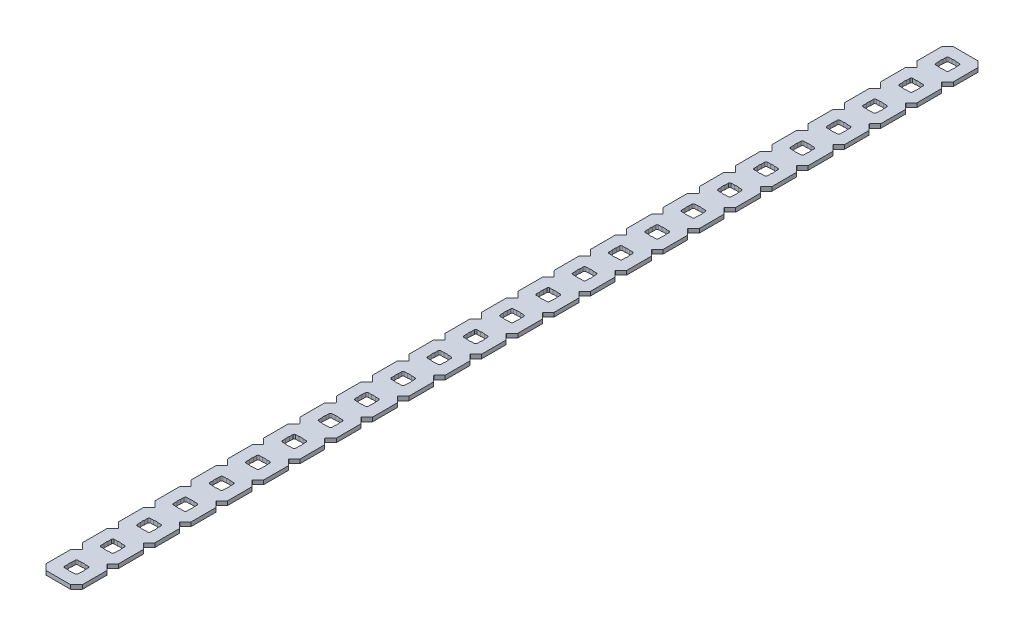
from build123d import *

# Parameters (mm, degrees)
BOSS_EXTRUDE1_DEPTH = 1.4224
SKETCH2_R           = 2.413
CUT_EXTRUDE1_DEPTH  = 2.54
LPATTERN1_COUNT     = 25
LPATTERN1_PITCH     = 12.7


with BuildPart() as part:
    # Sketch1 → Boss-Extrude1 (new body)
    with BuildSketch(Plane.XZ):
        with BuildLine():
            Line((12.7, -302.773014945), (12.7, -294.126985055))
            Line((12.7, -294.126985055), (10.762817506, -292.189802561))
            ThreePointArc((10.762817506, -292.189802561), (10.725620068, -292.1), (10.762817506, -292.010197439))
            Line((10.762817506, -292.010197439), (12.7, -290.073014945))
            Line((12.7, -290.073014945), (12.7, -281.426985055))
            Line((12.7, -281.426985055), (10.762817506, -279.489802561))
            ThreePointArc((10.762817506, -279.489802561), (10.725620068, -279.4), (10.762817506, -279.310197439))
            Line((10.762817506, -279.310197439), (12.7, -277.373014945))
            Line((12.7, -277.373014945), (12.7, -268.726985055))
            Line((12.7, -268.726985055), (10.762817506, -266.789802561))
            ThreePointArc((10.762817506, -266.789802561), (10.725620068, -266.7), (10.762817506, -266.610197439))
            Line((10.762817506, -266.610197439), (12.7, -264.673014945))
            Line((12.7, -264.673014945), (12.7, -256.026985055))
            Line((12.7, -256.026985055), (10.762817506, -254.089802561))
            ThreePointArc((10.762817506, -254.089802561), (10.725620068, -254), (10.762817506, -253.910197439))
            Line((10.762817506, -253.910197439), (12.7, -251.973014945))
            Line((12.7, -251.973014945), (12.7, -243.326985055))
            Line((12.7, -243.326985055), (10.762817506, -241.389802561))
            ThreePointArc((10.762817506, -241.389802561), (10.725620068, -241.3), (10.762817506, -241.210197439))
            Line((10.762817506, -241.210197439), (12.7, -239.273014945))
            Line((12.7, -239.273014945), (12.7, -230.626985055))
            Line((12.7, -230.626985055), (10.762817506, -228.689802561))
            ThreePointArc((10.762817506, -228.689802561), (10.725620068, -228.6), (10.762817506, -228.510197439))
            Line((10.762817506, -228.510197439), (12.7, -226.573014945))
            Line((12.7, -226.573014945), (12.7, -217.926985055))
            Line((12.7, -217.926985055), (10.762817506, -215.989802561))
            ThreePointArc((10.762817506, -215.989802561), (10.725620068, -215.9), (10.762817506, -215.810197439))
            Line((10.762817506, -215.810197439), (12.7, -213.873014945))
            Line((12.7, -213.873014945), (12.7, -205.226985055))
            Line((12.7, -205.226985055), (10.762817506, -203.289802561))
            ThreePointArc((10.762817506, -203.289802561), (10.725620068, -203.2), (10.762817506, -203.110197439))
            Line((10.762817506, -203.110197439), (12.7, -201.173014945))
            Line((12.7, -201.173014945), (12.7, -192.526985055))
            Line((12.7, -192.526985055), (10.762817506, -190.589802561))
            ThreePointArc((10.762817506, -190.589802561), (10.725620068, -190.5), (10.762817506, -190.410197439))
            Line((10.762817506, -190.410197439), (12.7, -188.473014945))
            Line((12.7, -188.473014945), (12.7, -179.826985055))
            Line((12.7, -179.826985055), (10.762817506, -177.889802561))
            ThreePointArc((10.762817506, -177.889802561), (10.725620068, -177.8), (10.762817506, -177.710197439))
            Line((10.762817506, -177.710197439), (12.7, -175.773014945))
            Line((12.7, -175.773014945), (12.7, -167.126985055))
            Line((12.7, -167.126985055), (10.762817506, -165.189802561))
            ThreePointArc((10.762817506, -165.189802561), (10.725620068, -165.1), (10.762817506, -165.010197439))
            Line((10.762817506, -165.010197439), (12.7, -163.073014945))
            Line((12.7, -163.073014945), (12.7, -154.426985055))
            Line((12.7, -154.426985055), (10.762817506, -152.489802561))
            ThreePointArc((10.762817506, -152.489802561), (10.725620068, -152.4), (10.762817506, -152.310197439))
            Line((10.762817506, -152.310197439), (12.7, -150.373014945))
            Line((12.7, -150.373014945), (12.7, -141.726985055))
            Line((12.7, -141.726985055), (10.762817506, -139.789802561))
            ThreePointArc((10.762817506, -139.789802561), (10.725620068, -139.7), (10.762817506, -139.610197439))
            Line((10.762817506, -139.610197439), (12.7, -137.673014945))
            Line((12.7, -137.673014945), (12.7, -129.026985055))
            Line((12.7, -129.026985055), (10.762817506, -127.089802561))
            ThreePointArc((10.762817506, -127.089802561), (10.725620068, -127), (10.762817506, -126.910197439))
            Line((10.762817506, -126.910197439), (12.7, -124.973014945))
            Line((12.7, -124.973014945), (12.7, -116.326985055))
            Line((12.7, -116.326985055), (10.762817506, -114.389802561))
            ThreePointArc((10.762817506, -114.389802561), (10.725620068, -114.3), (10.762817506, -114.210197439))
            Line((10.762817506, -114.210197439), (12.7, -112.273014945))
            Line((12.7, -112.273014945), (12.7, -103.626985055))
            Line((12.7, -103.626985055), (10.762817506, -101.689802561))
            ThreePointArc((10.762817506, -101.689802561), (10.725620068, -101.6), (10.762817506, -101.510197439))
            Line((10.762817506, -101.510197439), (12.7, -99.573014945))
            Line((12.7, -99.573014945), (12.7, -90.926985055))
            Line((12.7, -90.926985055), (10.762817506, -88.989802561))
            ThreePointArc((10.762817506, -88.989802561), (10.725620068, -88.9), (10.762817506, -88.810197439))
            Line((10.762817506, -88.810197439), (12.7, -86.873014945))
            Line((12.7, -86.873014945), (12.7, -78.226985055))
            Line((12.7, -78.226985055), (10.762817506, -76.289802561))
            ThreePointArc((10.762817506, -76.289802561), (10.725620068, -76.2), (10.762817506, -76.110197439))
            Line((10.762817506, -76.110197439), (12.7, -74.173014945))
            Line((12.7, -74.173014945), (12.7, -65.526985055))
            Line((12.7, -65.526985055), (10.762817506, -63.589802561))
            ThreePointArc((10.762817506, -63.589802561), (10.725620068, -63.5), (10.762817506, -63.410197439))
            Line((10.762817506, -63.410197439), (12.7, -61.473014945))
            Line((12.7, -61.473014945), (12.7, -52.826985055))
            Line((12.7, -52.826985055), (10.762817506, -50.889802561))
            ThreePointArc((10.762817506, -50.889802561), (10.725620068, -50.8), (10.762817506, -50.710197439))
            Line((10.762817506, -50.710197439), (12.7, -48.773014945))
            Line((12.7, -48.773014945), (12.7, -40.126985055))
            Line((12.7, -40.126985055), (10.762817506, -38.189802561))
            ThreePointArc((10.762817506, -38.189802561), (10.725620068, -38.1), (10.762817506, -38.010197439))
            Line((10.762817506, -38.010197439), (12.7, -36.073014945))
            Line((12.7, -36.073014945), (12.7, -27.426985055))
            Line((12.7, -27.426985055), (10.762817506, -25.489802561))
            ThreePointArc((10.762817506, -25.489802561), (10.725620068, -25.4), (10.762817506, -25.310197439))
            Line((10.762817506, -25.310197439), (12.7, -23.373014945))
            Line((12.7, -23.373014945), (12.7, -14.726985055))
            Line((12.7, -14.726985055), (10.762817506, -12.789802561))
            ThreePointArc((10.762817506, -12.789802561), (10.725620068, -12.7), (10.762817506, -12.610197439))
            Line((10.762817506, -12.610197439), (12.7, -10.673014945))
            Line((12.7, -10.673014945), (12.7, -2.032))
            Line((12.7, -2.032), (10.668, 0))
            Line((10.668, 0), (2.032, 0))
            Line((2.032, 0), (0, -2.032))
            Line((0, -2.032), (0, -10.673014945))
            Line((0, -10.673014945), (1.937182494, -12.610197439))
            ThreePointArc((1.937182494, -12.610197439), (1.974379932, -12.7), (1.937182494, -12.789802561))
            Line((1.937182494, -12.789802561), (0, -14.726985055))
            Line((0, -14.726985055), (0, -23.373014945))
            Line((0, -23.373014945), (1.937182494, -25.310197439))
            ThreePointArc((1.937182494, -25.310197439), (1.974379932, -25.4), (1.937182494, -25.489802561))
            Line((1.937182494, -25.489802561), (0, -27.426985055))
            Line((0, -27.426985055), (0, -36.073014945))
            Line((0, -36.073014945), (1.937182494, -38.010197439))
            ThreePointArc((1.937182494, -38.010197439), (1.974379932, -38.1), (1.937182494, -38.189802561))
            Line((1.937182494, -38.189802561), (0, -40.126985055))
            Line((0, -40.126985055), (0, -48.773014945))
            Line((0, -48.773014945), (1.937182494, -50.710197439))
            ThreePointArc((1.937182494, -50.710197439), (1.974379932, -50.8), (1.937182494, -50.889802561))
            Line((1.937182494, -50.889802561), (0, -52.826985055))
            Line((0, -52.826985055), (0, -61.473014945))
            Line((0, -61.473014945), (1.937182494, -63.410197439))
            ThreePointArc((1.937182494, -63.410197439), (1.974379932, -63.5), (1.937182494, -63.589802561))
            Line((1.937182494, -63.589802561), (0, -65.526985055))
            Line((0, -65.526985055), (0, -74.173014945))
            Line((0, -74.173014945), (1.937182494, -76.110197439))
            ThreePointArc((1.937182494, -76.110197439), (1.974379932, -76.2), (1.937182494, -76.289802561))
            Line((1.937182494, -76.289802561), (0, -78.226985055))
            Line((0, -78.226985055), (0, -86.873014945))
            Line((0, -86.873014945), (1.937182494, -88.810197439))
            ThreePointArc((1.937182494, -88.810197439), (1.974379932, -88.9), (1.937182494, -88.989802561))
            Line((1.937182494, -88.989802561), (0, -90.926985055))
            Line((0, -90.926985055), (0, -99.573014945))
            Line((0, -99.573014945), (1.937182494, -101.510197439))
            ThreePointArc((1.937182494, -101.510197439), (1.974379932, -101.6), (1.937182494, -101.689802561))
            Line((1.937182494, -101.689802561), (0, -103.626985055))
            Line((0, -103.626985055), (0, -112.273014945))
            Line((0, -112.273014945), (1.937182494, -114.210197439))
            ThreePointArc((1.937182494, -114.210197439), (1.974379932, -114.3), (1.937182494, -114.389802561))
            Line((1.937182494, -114.389802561), (0, -116.326985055))
            Line((0, -116.326985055), (0, -124.973014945))
            Line((0, -124.973014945), (1.937182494, -126.910197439))
            ThreePointArc((1.937182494, -126.910197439), (1.974379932, -127), (1.937182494, -127.089802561))
            Line((1.937182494, -127.089802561), (0, -129.026985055))
            Line((0, -129.026985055), (0, -137.673014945))
            Line((0, -137.673014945), (1.937182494, -139.610197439))
            ThreePointArc((1.937182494, -139.610197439), (1.974379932, -139.7), (1.937182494, -139.789802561))
            Line((1.937182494, -139.789802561), (0, -141.726985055))
            Line((0, -141.726985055), (0, -150.373014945))
            Line((0, -150.373014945), (1.937182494, -152.310197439))
            ThreePointArc((1.937182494, -152.310197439), (1.974379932, -152.4), (1.937182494, -152.489802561))
            Line((1.937182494, -152.489802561), (0, -154.426985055))
            Line((0, -154.426985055), (0, -163.073014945))
            Line((0, -163.073014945), (1.937182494, -165.010197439))
            ThreePointArc((1.937182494, -165.010197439), (1.974379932, -165.1), (1.937182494, -165.189802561))
            Line((1.937182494, -165.189802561), (0, -167.126985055))
            Line((0, -167.126985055), (0, -175.773014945))
            Line((0, -175.773014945), (1.937182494, -177.710197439))
            ThreePointArc((1.937182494, -177.710197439), (1.974379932, -177.8), (1.937182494, -177.889802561))
            Line((1.937182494, -177.889802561), (0, -179.826985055))
            Line((0, -179.826985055), (0, -188.473014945))
            Line((0, -188.473014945), (1.937182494, -190.410197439))
            ThreePointArc((1.937182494, -190.410197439), (1.974379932, -190.5), (1.937182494, -190.589802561))
            Line((1.937182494, -190.589802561), (0, -192.526985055))
            Line((0, -192.526985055), (0, -201.173014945))
            Line((0, -201.173014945), (1.937182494, -203.110197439))
            ThreePointArc((1.937182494, -203.110197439), (1.974379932, -203.2), (1.937182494, -203.289802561))
            Line((1.937182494, -203.289802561), (0, -205.226985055))
            Line((0, -205.226985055), (0, -213.873014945))
            Line((0, -213.873014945), (1.937182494, -215.810197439))
            ThreePointArc((1.937182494, -215.810197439), (1.974379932, -215.9), (1.937182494, -215.989802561))
            Line((1.937182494, -215.989802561), (0, -217.926985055))
            Line((0, -217.926985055), (0, -226.573014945))
            Line((0, -226.573014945), (1.937182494, -228.510197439))
            ThreePointArc((1.937182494, -228.510197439), (1.974379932, -228.6), (1.937182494, -228.689802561))
            Line((1.937182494, -228.689802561), (0, -230.626985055))
            Line((0, -230.626985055), (0, -239.273014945))
            Line((0, -239.273014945), (1.937182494, -241.210197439))
            ThreePointArc((1.937182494, -241.210197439), (1.974379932, -241.3), (1.937182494, -241.389802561))
            Line((1.937182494, -241.389802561), (0, -243.326985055))
            Line((0, -243.326985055), (0, -251.973014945))
            Line((0, -251.973014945), (1.937182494, -253.910197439))
            ThreePointArc((1.937182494, -253.910197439), (1.974379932, -254), (1.937182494, -254.089802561))
            Line((1.937182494, -254.089802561), (0, -256.026985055))
            Line((0, -256.026985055), (0, -264.673014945))
            Line((0, -264.673014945), (1.937182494, -266.610197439))
            ThreePointArc((1.937182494, -266.610197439), (1.974379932, -266.7), (1.937182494, -266.789802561))
            Line((1.937182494, -266.789802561), (0, -268.726985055))
            Line((0, -268.726985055), (0, -277.373014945))
            Line((0, -277.373014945), (1.937182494, -279.310197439))
            ThreePointArc((1.937182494, -279.310197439), (1.974379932, -279.4), (1.937182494, -279.489802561))
            Line((1.937182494, -279.489802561), (0, -281.426985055))
            Line((0, -281.426985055), (0, -290.073014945))
            Line((0, -290.073014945), (1.937182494, -292.010197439))
            ThreePointArc((1.937182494, -292.010197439), (1.974379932, -292.1), (1.937182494, -292.189802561))
            Line((1.937182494, -292.189802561), (0, -294.126985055))
            Line((0, -294.126985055), (0, -302.773014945))
            Line((0, -302.773014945), (1.937182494, -304.710197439))
            ThreePointArc((1.937182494, -304.710197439), (1.974379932, -304.8), (1.937182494, -304.889802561))
            Line((1.937182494, -304.889802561), (0, -306.826985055))
            Line((0, -306.826985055), (0, -315.468))
            Line((0, -315.468), (2.032, -317.5))
            Line((2.032, -317.5), (10.668, -317.5))
            Line((10.668, -317.5), (12.7, -315.468))
            Line((12.7, -315.468), (12.7, -306.826985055))
            Line((12.7, -306.826985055), (10.762817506, -304.889802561))
            ThreePointArc((10.762817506, -304.889802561), (10.725620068, -304.8), (10.762817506, -304.710197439))
            Line((10.762817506, -304.710197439), (12.7, -302.773014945))
        make_face()
        with BuildLine():
            Line((4.5466, -308.8386), (8.1534, -308.8386))
            ThreePointArc((8.1534, -308.8386), (8.512610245, -308.987389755), (8.6614, -309.3466))
            Line((8.6614, -309.3466), (8.6614, -312.9534))
            ThreePointArc((8.6614, -312.9534), (8.512610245, -313.312610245), (8.1534, -313.4614))
            Line((8.1534, -313.4614), (4.5466, -313.4614))
            ThreePointArc((4.5466, -313.4614), (4.187389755, -313.312610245), (4.0386, -312.9534))
            Line((4.0386, -312.9534), (4.0386, -309.3466))
            ThreePointArc((4.0386, -309.3466), (4.187389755, -308.987389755), (4.5466, -308.8386))
        make_face(mode=Mode.SUBTRACT)
        with BuildLine():
            Line((4.5466, -296.1386), (8.1534, -296.1386))
            ThreePointArc((8.1534, -296.1386), (8.512610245, -296.287389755), (8.6614, -296.6466))
            Line((8.6614, -296.6466), (8.6614, -300.2534))
            ThreePointArc((8.6614, -300.2534), (8.512610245, -300.612610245), (8.1534, -300.7614))
            Line((8.1534, -300.7614), (4.5466, -300.7614))
            ThreePointArc((4.5466, -300.7614), (4.187389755, -300.612610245), (4.0386, -300.2534))
            Line((4.0386, -300.2534), (4.0386, -296.6466))
            ThreePointArc((4.0386, -296.6466), (4.187389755, -296.287389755), (4.5466, -296.1386))
        make_face(mode=Mode.SUBTRACT)
        with BuildLine():
            Line((4.5466, -283.4386), (8.1534, -283.4386))
            ThreePointArc((8.1534, -283.4386), (8.512610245, -283.587389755), (8.6614, -283.9466))
            Line((8.6614, -283.9466), (8.6614, -287.5534))
            ThreePointArc((8.6614, -287.5534), (8.512610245, -287.912610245), (8.1534, -288.0614))
            Line((8.1534, -288.0614), (4.5466, -288.0614))
            ThreePointArc((4.5466, -288.0614), (4.187389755, -287.912610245), (4.0386, -287.5534))
            Line((4.0386, -287.5534), (4.0386, -283.9466))
            ThreePointArc((4.0386, -283.9466), (4.187389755, -283.587389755), (4.5466, -283.4386))
        make_face(mode=Mode.SUBTRACT)
        with BuildLine():
            Line((4.5466, -270.7386), (8.1534, -270.7386))
            ThreePointArc((8.1534, -270.7386), (8.512610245, -270.887389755), (8.6614, -271.2466))
            Line((8.6614, -271.2466), (8.6614, -274.8534))
            ThreePointArc((8.6614, -274.8534), (8.512610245, -275.212610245), (8.1534, -275.3614))
            Line((8.1534, -275.3614), (4.5466, -275.3614))
            ThreePointArc((4.5466, -275.3614), (4.187389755, -275.212610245), (4.0386, -274.8534))
            Line((4.0386, -274.8534), (4.0386, -271.2466))
            ThreePointArc((4.0386, -271.2466), (4.187389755, -270.887389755), (4.5466, -270.7386))
        make_face(mode=Mode.SUBTRACT)
        with BuildLine():
            Line((4.5466, -258.0386), (8.1534, -258.0386))
            ThreePointArc((8.1534, -258.0386), (8.512610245, -258.187389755), (8.6614, -258.5466))
            Line((8.6614, -258.5466), (8.6614, -262.1534))
            ThreePointArc((8.6614, -262.1534), (8.512610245, -262.512610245), (8.1534, -262.6614))
            Line((8.1534, -262.6614), (4.5466, -262.6614))
            ThreePointArc((4.5466, -262.6614), (4.187389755, -262.512610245), (4.0386, -262.1534))
            Line((4.0386, -262.1534), (4.0386, -258.5466))
            ThreePointArc((4.0386, -258.5466), (4.187389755, -258.187389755), (4.5466, -258.0386))
        make_face(mode=Mode.SUBTRACT)
        with BuildLine():
            Line((4.5466, -245.3386), (8.1534, -245.3386))
            ThreePointArc((8.1534, -245.3386), (8.512610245, -245.487389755), (8.6614, -245.8466))
            Line((8.6614, -245.8466), (8.6614, -249.4534))
            ThreePointArc((8.6614, -249.4534), (8.512610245, -249.812610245), (8.1534, -249.9614))
            Line((8.1534, -249.9614), (4.5466, -249.9614))
            ThreePointArc((4.5466, -249.9614), (4.187389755, -249.812610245), (4.0386, -249.4534))
            Line((4.0386, -249.4534), (4.0386, -245.8466))
            ThreePointArc((4.0386, -245.8466), (4.187389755, -245.487389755), (4.5466, -245.3386))
        make_face(mode=Mode.SUBTRACT)
        with BuildLine():
            Line((4.5466, -232.6386), (8.1534, -232.6386))
            ThreePointArc((8.1534, -232.6386), (8.512610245, -232.787389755), (8.6614, -233.1466))
            Line((8.6614, -233.1466), (8.6614, -236.7534))
            ThreePointArc((8.6614, -236.7534), (8.512610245, -237.112610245), (8.1534, -237.2614))
            Line((8.1534, -237.2614), (4.5466, -237.2614))
            ThreePointArc((4.5466, -237.2614), (4.187389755, -237.112610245), (4.0386, -236.7534))
            Line((4.0386, -236.7534), (4.0386, -233.1466))
            ThreePointArc((4.0386, -233.1466), (4.187389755, -232.787389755), (4.5466, -232.6386))
        make_face(mode=Mode.SUBTRACT)
        with BuildLine():
            Line((4.5466, -219.9386), (8.1534, -219.9386))
            ThreePointArc((8.1534, -219.9386), (8.512610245, -220.087389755), (8.6614, -220.4466))
            Line((8.6614, -220.4466), (8.6614, -224.0534))
            ThreePointArc((8.6614, -224.0534), (8.512610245, -224.412610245), (8.1534, -224.5614))
            Line((8.1534, -224.5614), (4.5466, -224.5614))
            ThreePointArc((4.5466, -224.5614), (4.187389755, -224.412610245), (4.0386, -224.0534))
            Line((4.0386, -224.0534), (4.0386, -220.4466))
            ThreePointArc((4.0386, -220.4466), (4.187389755, -220.087389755), (4.5466, -219.9386))
        make_face(mode=Mode.SUBTRACT)
        with BuildLine():
            Line((4.5466, -207.2386), (8.1534, -207.2386))
            ThreePointArc((8.1534, -207.2386), (8.512610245, -207.387389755), (8.6614, -207.7466))
            Line((8.6614, -207.7466), (8.6614, -211.3534))
            ThreePointArc((8.6614, -211.3534), (8.512610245, -211.712610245), (8.1534, -211.8614))
            Line((8.1534, -211.8614), (4.5466, -211.8614))
            ThreePointArc((4.5466, -211.8614), (4.187389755, -211.712610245), (4.0386, -211.3534))
            Line((4.0386, -211.3534), (4.0386, -207.7466))
            ThreePointArc((4.0386, -207.7466), (4.187389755, -207.387389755), (4.5466, -207.2386))
        make_face(mode=Mode.SUBTRACT)
        with BuildLine():
            Line((4.5466, -194.5386), (8.1534, -194.5386))
            ThreePointArc((8.1534, -194.5386), (8.512610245, -194.687389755), (8.6614, -195.0466))
            Line((8.6614, -195.0466), (8.6614, -198.6534))
            ThreePointArc((8.6614, -198.6534), (8.512610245, -199.012610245), (8.1534, -199.1614))
            Line((8.1534, -199.1614), (4.5466, -199.1614))
            ThreePointArc((4.5466, -199.1614), (4.187389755, -199.012610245), (4.0386, -198.6534))
            Line((4.0386, -198.6534), (4.0386, -195.0466))
            ThreePointArc((4.0386, -195.0466), (4.187389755, -194.687389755), (4.5466, -194.5386))
        make_face(mode=Mode.SUBTRACT)
        with BuildLine():
            Line((4.5466, -181.8386), (8.1534, -181.8386))
            ThreePointArc((8.1534, -181.8386), (8.512610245, -181.987389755), (8.6614, -182.3466))
            Line((8.6614, -182.3466), (8.6614, -185.9534))
            ThreePointArc((8.6614, -185.9534), (8.512610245, -186.312610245), (8.1534, -186.4614))
            Line((8.1534, -186.4614), (4.5466, -186.4614))
            ThreePointArc((4.5466, -186.4614), (4.187389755, -186.312610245), (4.0386, -185.9534))
            Line((4.0386, -185.9534), (4.0386, -182.3466))
            ThreePointArc((4.0386, -182.3466), (4.187389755, -181.987389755), (4.5466, -181.8386))
        make_face(mode=Mode.SUBTRACT)
        with BuildLine():
            Line((4.5466, -169.1386), (8.1534, -169.1386))
            ThreePointArc((8.1534, -169.1386), (8.512610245, -169.287389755), (8.6614, -169.6466))
            Line((8.6614, -169.6466), (8.6614, -173.2534))
            ThreePointArc((8.6614, -173.2534), (8.512610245, -173.612610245), (8.1534, -173.7614))
            Line((8.1534, -173.7614), (4.5466, -173.7614))
            ThreePointArc((4.5466, -173.7614), (4.187389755, -173.612610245), (4.0386, -173.2534))
            Line((4.0386, -173.2534), (4.0386, -169.6466))
            ThreePointArc((4.0386, -169.6466), (4.187389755, -169.287389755), (4.5466, -169.1386))
        make_face(mode=Mode.SUBTRACT)
        with BuildLine():
            Line((4.5466, -156.4386), (8.1534, -156.4386))
            ThreePointArc((8.1534, -156.4386), (8.512610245, -156.587389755), (8.6614, -156.9466))
            Line((8.6614, -156.9466), (8.6614, -160.5534))
            ThreePointArc((8.6614, -160.5534), (8.512610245, -160.912610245), (8.1534, -161.0614))
            Line((8.1534, -161.0614), (4.5466, -161.0614))
            ThreePointArc((4.5466, -161.0614), (4.187389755, -160.912610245), (4.0386, -160.5534))
            Line((4.0386, -160.5534), (4.0386, -156.9466))
            ThreePointArc((4.0386, -156.9466), (4.187389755, -156.587389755), (4.5466, -156.4386))
        make_face(mode=Mode.SUBTRACT)
        with BuildLine():
            Line((4.5466, -143.7386), (8.1534, -143.7386))
            ThreePointArc((8.1534, -143.7386), (8.512610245, -143.887389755), (8.6614, -144.2466))
            Line((8.6614, -144.2466), (8.6614, -147.8534))
            ThreePointArc((8.6614, -147.8534), (8.512610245, -148.212610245), (8.1534, -148.3614))
            Line((8.1534, -148.3614), (4.5466, -148.3614))
            ThreePointArc((4.5466, -148.3614), (4.187389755, -148.212610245), (4.0386, -147.8534))
            Line((4.0386, -147.8534), (4.0386, -144.2466))
            ThreePointArc((4.0386, -144.2466), (4.187389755, -143.887389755), (4.5466, -143.7386))
        make_face(mode=Mode.SUBTRACT)
        with BuildLine():
            Line((4.5466, -131.0386), (8.1534, -131.0386))
            ThreePointArc((8.1534, -131.0386), (8.512610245, -131.187389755), (8.6614, -131.5466))
            Line((8.6614, -131.5466), (8.6614, -135.1534))
            ThreePointArc((8.6614, -135.1534), (8.512610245, -135.512610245), (8.1534, -135.6614))
            Line((8.1534, -135.6614), (4.5466, -135.6614))
            ThreePointArc((4.5466, -135.6614), (4.187389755, -135.512610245), (4.0386, -135.1534))
            Line((4.0386, -135.1534), (4.0386, -131.5466))
            ThreePointArc((4.0386, -131.5466), (4.187389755, -131.187389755), (4.5466, -131.0386))
        make_face(mode=Mode.SUBTRACT)
        with BuildLine():
            Line((4.5466, -118.3386), (8.1534, -118.3386))
            ThreePointArc((8.1534, -118.3386), (8.512610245, -118.487389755), (8.6614, -118.8466))
            Line((8.6614, -118.8466), (8.6614, -122.4534))
            ThreePointArc((8.6614, -122.4534), (8.512610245, -122.812610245), (8.1534, -122.9614))
            Line((8.1534, -122.9614), (4.5466, -122.9614))
            ThreePointArc((4.5466, -122.9614), (4.187389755, -122.812610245), (4.0386, -122.4534))
            Line((4.0386, -122.4534), (4.0386, -118.8466))
            ThreePointArc((4.0386, -118.8466), (4.187389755, -118.487389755), (4.5466, -118.3386))
        make_face(mode=Mode.SUBTRACT)
        with BuildLine():
            Line((4.5466, -105.6386), (8.1534, -105.6386))
            ThreePointArc((8.1534, -105.6386), (8.512610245, -105.787389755), (8.6614, -106.1466))
            Line((8.6614, -106.1466), (8.6614, -109.7534))
            ThreePointArc((8.6614, -109.7534), (8.512610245, -110.112610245), (8.1534, -110.2614))
            Line((8.1534, -110.2614), (4.5466, -110.2614))
            ThreePointArc((4.5466, -110.2614), (4.187389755, -110.112610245), (4.0386, -109.7534))
            Line((4.0386, -109.7534), (4.0386, -106.1466))
            ThreePointArc((4.0386, -106.1466), (4.187389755, -105.787389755), (4.5466, -105.6386))
        make_face(mode=Mode.SUBTRACT)
        with BuildLine():
            Line((4.5466, -92.9386), (8.1534, -92.9386))
            ThreePointArc((8.1534, -92.9386), (8.512610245, -93.087389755), (8.6614, -93.4466))
            Line((8.6614, -93.4466), (8.6614, -97.0534))
            ThreePointArc((8.6614, -97.0534), (8.512610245, -97.412610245), (8.1534, -97.5614))
            Line((8.1534, -97.5614), (4.5466, -97.5614))
            ThreePointArc((4.5466, -97.5614), (4.187389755, -97.412610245), (4.0386, -97.0534))
            Line((4.0386, -97.0534), (4.0386, -93.4466))
            ThreePointArc((4.0386, -93.4466), (4.187389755, -93.087389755), (4.5466, -92.9386))
        make_face(mode=Mode.SUBTRACT)
        with BuildLine():
            Line((4.5466, -80.2386), (8.1534, -80.2386))
            ThreePointArc((8.1534, -80.2386), (8.512610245, -80.387389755), (8.6614, -80.7466))
            Line((8.6614, -80.7466), (8.6614, -84.3534))
            ThreePointArc((8.6614, -84.3534), (8.512610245, -84.712610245), (8.1534, -84.8614))
            Line((8.1534, -84.8614), (4.5466, -84.8614))
            ThreePointArc((4.5466, -84.8614), (4.187389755, -84.712610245), (4.0386, -84.3534))
            Line((4.0386, -84.3534), (4.0386, -80.7466))
            ThreePointArc((4.0386, -80.7466), (4.187389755, -80.387389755), (4.5466, -80.2386))
        make_face(mode=Mode.SUBTRACT)
        with BuildLine():
            Line((4.5466, -67.5386), (8.1534, -67.5386))
            ThreePointArc((8.1534, -67.5386), (8.512610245, -67.687389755), (8.6614, -68.0466))
            Line((8.6614, -68.0466), (8.6614, -71.6534))
            ThreePointArc((8.6614, -71.6534), (8.512610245, -72.012610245), (8.1534, -72.1614))
            Line((8.1534, -72.1614), (4.5466, -72.1614))
            ThreePointArc((4.5466, -72.1614), (4.187389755, -72.012610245), (4.0386, -71.6534))
            Line((4.0386, -71.6534), (4.0386, -68.0466))
            ThreePointArc((4.0386, -68.0466), (4.187389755, -67.687389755), (4.5466, -67.5386))
        make_face(mode=Mode.SUBTRACT)
        with BuildLine():
            Line((4.5466, -54.8386), (8.1534, -54.8386))
            ThreePointArc((8.1534, -54.8386), (8.512610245, -54.987389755), (8.6614, -55.3466))
            Line((8.6614, -55.3466), (8.6614, -58.9534))
            ThreePointArc((8.6614, -58.9534), (8.512610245, -59.312610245), (8.1534, -59.4614))
            Line((8.1534, -59.4614), (4.5466, -59.4614))
            ThreePointArc((4.5466, -59.4614), (4.187389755, -59.312610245), (4.0386, -58.9534))
            Line((4.0386, -58.9534), (4.0386, -55.3466))
            ThreePointArc((4.0386, -55.3466), (4.187389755, -54.987389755), (4.5466, -54.8386))
        make_face(mode=Mode.SUBTRACT)
        with BuildLine():
            Line((4.5466, -42.1386), (8.1534, -42.1386))
            ThreePointArc((8.1534, -42.1386), (8.512610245, -42.287389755), (8.6614, -42.6466))
            Line((8.6614, -42.6466), (8.6614, -46.2534))
            ThreePointArc((8.6614, -46.2534), (8.512610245, -46.612610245), (8.1534, -46.7614))
            Line((8.1534, -46.7614), (4.5466, -46.7614))
            ThreePointArc((4.5466, -46.7614), (4.187389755, -46.612610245), (4.0386, -46.2534))
            Line((4.0386, -46.2534), (4.0386, -42.6466))
            ThreePointArc((4.0386, -42.6466), (4.187389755, -42.287389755), (4.5466, -42.1386))
        make_face(mode=Mode.SUBTRACT)
        with BuildLine():
            Line((4.5466, -29.4386), (8.1534, -29.4386))
            ThreePointArc((8.1534, -29.4386), (8.512610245, -29.587389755), (8.6614, -29.9466))
            Line((8.6614, -29.9466), (8.6614, -33.5534))
            ThreePointArc((8.6614, -33.5534), (8.512610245, -33.912610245), (8.1534, -34.0614))
            Line((8.1534, -34.0614), (4.5466, -34.0614))
            ThreePointArc((4.5466, -34.0614), (4.187389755, -33.912610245), (4.0386, -33.5534))
            Line((4.0386, -33.5534), (4.0386, -29.9466))
            ThreePointArc((4.0386, -29.9466), (4.187389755, -29.587389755), (4.5466, -29.4386))
        make_face(mode=Mode.SUBTRACT)
        with BuildLine():
            Line((8.1534, -8.6614), (4.5466, -8.6614))
            ThreePointArc((4.5466, -8.6614), (4.187389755, -8.512610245), (4.0386, -8.1534))
            Line((4.0386, -8.1534), (4.0386, -4.5466))
            ThreePointArc((4.0386, -4.5466), (4.187389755, -4.187389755), (4.5466, -4.0386))
            Line((4.5466, -4.0386), (8.1534, -4.0386))
            ThreePointArc((8.1534, -4.0386), (8.512610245, -4.187389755), (8.6614, -4.5466))
            Line((8.6614, -4.5466), (8.6614, -8.1534))
            ThreePointArc((8.6614, -8.1534), (8.512610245, -8.512610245), (8.1534, -8.6614))
        make_face(mode=Mode.SUBTRACT)
        with BuildLine():
            Line((4.0386, -20.8534), (4.0386, -17.2466))
            ThreePointArc((4.0386, -17.2466), (4.187389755, -16.887389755), (4.5466, -16.7386))
            Line((4.5466, -16.7386), (8.1534, -16.7386))
            ThreePointArc((8.1534, -16.7386), (8.512610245, -16.887389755), (8.6614, -17.2466))
            Line((8.6614, -17.2466), (8.6614, -20.8534))
            ThreePointArc((8.6614, -20.8534), (8.512610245, -21.212610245), (8.1534, -21.3614))
            Line((8.1534, -21.3614), (4.5466, -21.3614))
            ThreePointArc((4.5466, -21.3614), (4.187389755, -21.212610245), (4.0386, -20.8534))
        make_face(mode=Mode.SUBTRACT)
    extrude(amount=-BOSS_EXTRUDE1_DEPTH)

    # Sketch2 → Cut-Extrude1 (cut)
    with BuildSketch(Plane(origin=(0, 1.4224, 0), x_dir=(1, 0, 0), z_dir=(0, 1, 0))):
        with Locations((6.35, 6.35)):
            Circle(SKETCH2_R)
    cut_extrude1 = extrude(amount=-CUT_EXTRUDE1_DEPTH, mode=Mode.SUBTRACT)

    # LPattern1: Cut-Extrude1 ×25
    with Locations(*[(0, 0, -i * LPATTERN1_PITCH) for i in range(1, LPATTERN1_COUNT)]):
        add(cut_extrude1, mode=Mode.SUBTRACT)


solid = part.part
